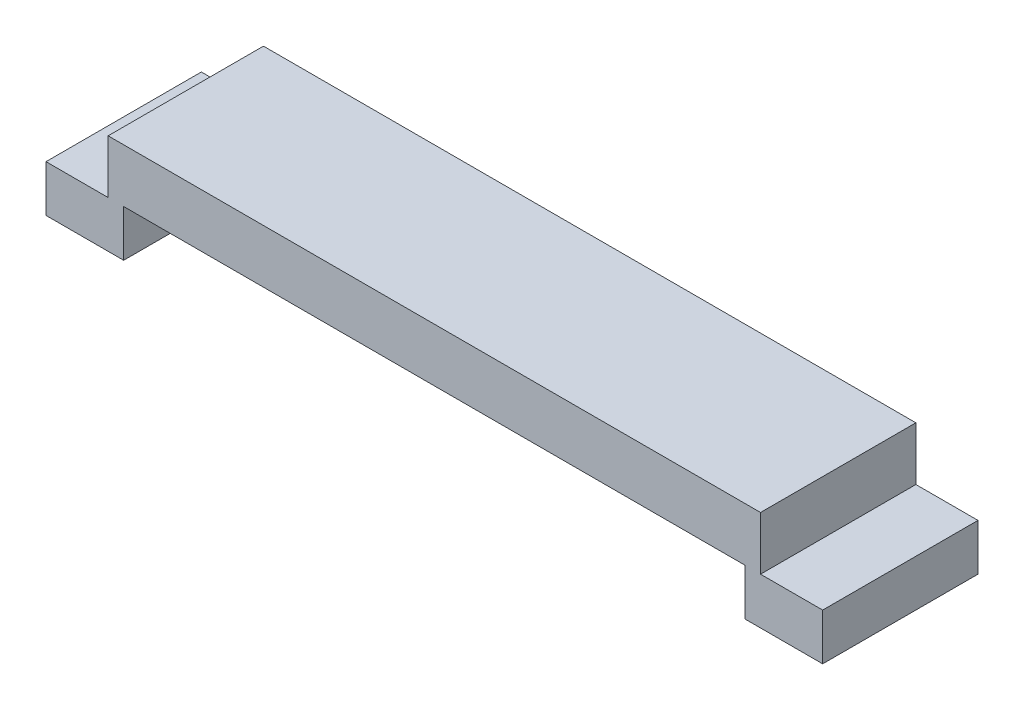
from build123d import *

# Parameters (mm, degrees)
SKETCH1_W           = 50
SKETCH1_H           = 30
BOSS_EXTRUDE2_DEPTH = 100


with BuildPart() as part:
    # Sketch1 → Boss-Extrude2 (new body)
    with BuildSketch(Plane.XY):
        Polygon((40, 34.411242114), (40, 0), (50, 0), (450, 0), (460, 0), (460, 34.411242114), align=None)
        with Locations((25, -15)):
            Rectangle(SKETCH1_W, SKETCH1_H)
        Polygon((460, 0), (450, 0), (450, -30), (500, -30), (500, 0), align=None)
    extrude(amount=BOSS_EXTRUDE2_DEPTH)


solid = part.part
